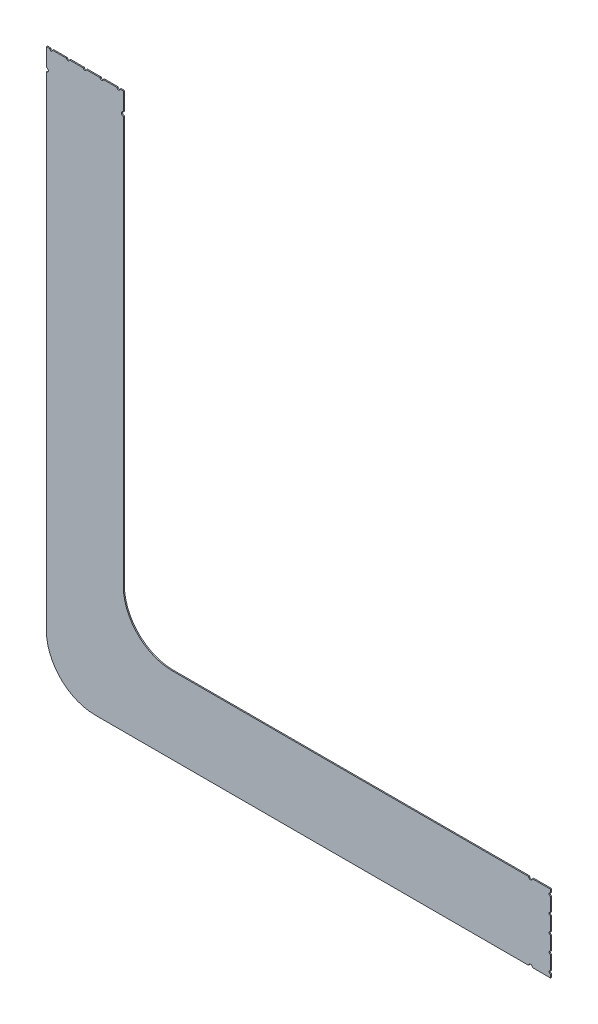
ISO-10303-21;
HEADER;
FILE_DESCRIPTION(('STEP AP214'),'2;1');
FILE_NAME('part.step','',(''),(''),'','','');
FILE_SCHEMA(('AUTOMOTIVE_DESIGN { 1 0 10303 214 1 1 1 1 }'));
ENDSEC;
DATA;
#1=APPLICATION_CONTEXT('core data for automotive mechanical design processes');
#2=APPLICATION_PROTOCOL_DEFINITION('international standard','automotive_design',2000,#1);
#3=PRODUCT_CONTEXT('',#1,'mechanical');
#4=PRODUCT('Part','Part','',(#3));
#5=PRODUCT_RELATED_PRODUCT_CATEGORY('part','',(#4));
#6=PRODUCT_DEFINITION_FORMATION('','',#4);
#7=PRODUCT_DEFINITION_CONTEXT('part definition',#1,'design');
#8=PRODUCT_DEFINITION('design','',#6,#7);
#9=PRODUCT_DEFINITION_SHAPE('','',#8);
#10=(LENGTH_UNIT() NAMED_UNIT(*) SI_UNIT(.MILLI.,.METRE.));
#11=(NAMED_UNIT(*) PLANE_ANGLE_UNIT() SI_UNIT($,.RADIAN.));
#12=(NAMED_UNIT(*) SI_UNIT($,.STERADIAN.) SOLID_ANGLE_UNIT());
#13=UNCERTAINTY_MEASURE_WITH_UNIT(LENGTH_MEASURE(1.E-05),#10,'distance_accuracy_value','');
#14=(GEOMETRIC_REPRESENTATION_CONTEXT(3) GLOBAL_UNCERTAINTY_ASSIGNED_CONTEXT((#13)) GLOBAL_UNIT_ASSIGNED_CONTEXT((#10,
#11,#12)) REPRESENTATION_CONTEXT('',''));
#15=CARTESIAN_POINT('',(0.,0.,0.));
#16=DIRECTION('',(0.,0.,1.));
#17=DIRECTION('',(1.,0.,0.));
#18=AXIS2_PLACEMENT_3D('',#15,#16,#17);
#19=CARTESIAN_POINT('',(65.5828,0.,0.14478));
#20=DIRECTION('',(0.,1.,0.));
#21=DIRECTION('',(0.,0.,1.));
#22=AXIS2_PLACEMENT_3D('',#19,#20,#21);
#23=PLANE('',#22);
#24=DIRECTION('',(0.,0.,-1.));
#25=VECTOR('',#24,1.);
#26=CARTESIAN_POINT('',(63.238329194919,0.,0.14478));
#27=LINE('',#26,#25);
#28=CARTESIAN_POINT('',(63.238329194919,0.,0.));
#29=VERTEX_POINT('',#28);
#30=CARTESIAN_POINT('',(63.238329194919,0.,0.14478));
#31=VERTEX_POINT('',#30);
#32=EDGE_CURVE('E513',#29,#31,#27,.F.);
#33=ORIENTED_EDGE('',*,*,#32,.F.);
#34=DIRECTION('',(1.,0.,0.));
#35=VECTOR('',#34,1.);
#36=CARTESIAN_POINT('',(65.5828,0.,0.));
#37=LINE('',#36,#35);
#38=CARTESIAN_POINT('',(65.5828,0.,0.));
#39=VERTEX_POINT('',#38);
#40=EDGE_CURVE('E371',#29,#39,#37,.T.);
#41=ORIENTED_EDGE('',*,*,#40,.T.);
#42=DIRECTION('',(0.,0.,-1.));
#43=VECTOR('',#42,1.);
#44=CARTESIAN_POINT('',(65.5828,0.,0.14478));
#45=LINE('',#44,#43);
#46=CARTESIAN_POINT('',(65.5828,0.,0.14478));
#47=VERTEX_POINT('',#46);
#48=EDGE_CURVE('E428',#47,#39,#45,.T.);
#49=ORIENTED_EDGE('',*,*,#48,.F.);
#50=DIRECTION('',(1.,0.,0.));
#51=VECTOR('',#50,1.);
#52=CARTESIAN_POINT('',(65.5828,0.,0.14478));
#53=LINE('',#52,#51);
#54=EDGE_CURVE('E542',#31,#47,#53,.T.);
#55=ORIENTED_EDGE('',*,*,#54,.F.);
#56=EDGE_LOOP('',(#33,#41,#49,#55));
#57=FACE_BOUND('',#56,.T.);
#58=ADVANCED_FACE('F15',(#57),#23,.F.);
#59=DIRECTION('',(0.,0.,-1.));
#60=VECTOR('',#59,1.);
#61=CARTESIAN_POINT('',(62.730430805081,0.,0.14478));
#62=LINE('',#61,#60);
#63=CARTESIAN_POINT('',(62.730430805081,0.,0.14478));
#64=VERTEX_POINT('',#63);
#65=CARTESIAN_POINT('',(62.730430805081,0.,0.));
#66=VERTEX_POINT('',#65);
#67=EDGE_CURVE('E30',#64,#66,#62,.T.);
#68=ORIENTED_EDGE('',*,*,#67,.F.);
#69=CARTESIAN_POINT('',(6.35,0.,0.14478));
#70=VERTEX_POINT('',#69);
#71=EDGE_CURVE('E335',#70,#64,#53,.T.);
#72=ORIENTED_EDGE('',*,*,#71,.F.);
#73=DIRECTION('',(0.,0.,-1.));
#74=VECTOR('',#73,1.);
#75=CARTESIAN_POINT('',(6.35,0.,0.14478));
#76=LINE('',#75,#74);
#77=CARTESIAN_POINT('',(6.35,0.,0.));
#78=VERTEX_POINT('',#77);
#79=EDGE_CURVE('E431',#70,#78,#76,.T.);
#80=ORIENTED_EDGE('',*,*,#79,.T.);
#81=EDGE_CURVE('E373',#78,#66,#37,.T.);
#82=ORIENTED_EDGE('',*,*,#81,.T.);
#83=EDGE_LOOP('',(#68,#72,#80,#82));
#84=FACE_BOUND('',#83,.T.);
#85=ADVANCED_FACE('F553',(#84),#23,.F.);
#86=CARTESIAN_POINT('',(65.5828,10.0076,0.14478));
#87=DIRECTION('',(-1.,0.,0.));
#88=DIRECTION('',(0.,0.,1.));
#89=AXIS2_PLACEMENT_3D('',#86,#87,#88);
#90=PLANE('',#89);
#91=DIRECTION('',(0.,0.,-1.));
#92=VECTOR('',#91,1.);
#93=CARTESIAN_POINT('',(65.5828,3.0099,0.14478));
#94=LINE('',#93,#92);
#95=CARTESIAN_POINT('',(65.5828,3.0099,0.));
#96=VERTEX_POINT('',#95);
#97=CARTESIAN_POINT('',(65.5828,3.0099,0.14478));
#98=VERTEX_POINT('',#97);
#99=EDGE_CURVE('E536',#96,#98,#94,.F.);
#100=ORIENTED_EDGE('',*,*,#99,.F.);
#101=DIRECTION('',(0.,1.,0.));
#102=VECTOR('',#101,1.);
#103=CARTESIAN_POINT('',(65.5828,10.0076,0.));
#104=LINE('',#103,#102);
#105=CARTESIAN_POINT('',(65.5828,4.81584,0.));
#106=VERTEX_POINT('',#105);
#107=EDGE_CURVE('E589',#96,#106,#104,.T.);
#108=ORIENTED_EDGE('',*,*,#107,.T.);
#109=DIRECTION('',(0.,0.,-1.));
#110=VECTOR('',#109,1.);
#111=CARTESIAN_POINT('',(65.5828,4.81584,0.14478));
#112=LINE('',#111,#110);
#113=CARTESIAN_POINT('',(65.5828,4.81584,0.14478));
#114=VERTEX_POINT('',#113);
#115=EDGE_CURVE('E525',#114,#106,#112,.T.);
#116=ORIENTED_EDGE('',*,*,#115,.F.);
#117=DIRECTION('',(0.,1.,0.));
#118=VECTOR('',#117,1.);
#119=CARTESIAN_POINT('',(65.5828,10.0076,0.14478));
#120=LINE('',#119,#118);
#121=EDGE_CURVE('E333',#98,#114,#120,.T.);
#122=ORIENTED_EDGE('',*,*,#121,.F.);
#123=EDGE_LOOP('',(#100,#108,#116,#122));
#124=FACE_BOUND('',#123,.T.);
#125=ADVANCED_FACE('F586',(#124),#90,.F.);
#126=DIRECTION('',(0.,0.,-1.));
#127=VECTOR('',#126,1.);
#128=CARTESIAN_POINT('',(65.5828,2.6289,0.14478));
#129=LINE('',#128,#127);
#130=CARTESIAN_POINT('',(65.5828,2.6289,0.14478));
#131=VERTEX_POINT('',#130);
#132=CARTESIAN_POINT('',(65.5828,2.6289,0.));
#133=VERTEX_POINT('',#132);
#134=EDGE_CURVE('E534',#131,#133,#129,.T.);
#135=ORIENTED_EDGE('',*,*,#134,.F.);
#136=CARTESIAN_POINT('',(65.5828,0.822959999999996,0.14478));
#137=VERTEX_POINT('',#136);
#138=EDGE_CURVE('E341',#137,#131,#120,.T.);
#139=ORIENTED_EDGE('',*,*,#138,.F.);
#140=DIRECTION('',(0.,0.,-1.));
#141=VECTOR('',#140,1.);
#142=CARTESIAN_POINT('',(65.5828,0.822959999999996,0.14478));
#143=LINE('',#142,#141);
#144=CARTESIAN_POINT('',(65.5828,0.822959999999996,0.));
#145=VERTEX_POINT('',#144);
#146=EDGE_CURVE('E523',#145,#137,#143,.F.);
#147=ORIENTED_EDGE('',*,*,#146,.F.);
#148=EDGE_CURVE('E382',#145,#133,#104,.T.);
#149=ORIENTED_EDGE('',*,*,#148,.T.);
#150=EDGE_LOOP('',(#135,#139,#147,#149));
#151=FACE_BOUND('',#150,.T.);
#152=ADVANCED_FACE('F574',(#151),#90,.F.);
#153=DIRECTION('',(0.,0.,-1.));
#154=VECTOR('',#153,1.);
#155=CARTESIAN_POINT('',(65.5828,5.19684,0.14478));
#156=LINE('',#155,#154);
#157=CARTESIAN_POINT('',(65.5828,5.19684,0.));
#158=VERTEX_POINT('',#157);
#159=CARTESIAN_POINT('',(65.5828,5.19684,0.14478));
#160=VERTEX_POINT('',#159);
#161=EDGE_CURVE('E528',#158,#160,#156,.F.);
#162=ORIENTED_EDGE('',*,*,#161,.F.);
#163=CARTESIAN_POINT('',(65.5828,7.00278,0.));
#164=VERTEX_POINT('',#163);
#165=EDGE_CURVE('E598',#158,#164,#104,.T.);
#166=ORIENTED_EDGE('',*,*,#165,.T.);
#167=DIRECTION('',(0.,0.,-1.));
#168=VECTOR('',#167,1.);
#169=CARTESIAN_POINT('',(65.5828,7.00278,0.14478));
#170=LINE('',#169,#168);
#171=CARTESIAN_POINT('',(65.5828,7.00278,0.14478));
#172=VERTEX_POINT('',#171);
#173=EDGE_CURVE('E311',#172,#164,#170,.T.);
#174=ORIENTED_EDGE('',*,*,#173,.F.);
#175=EDGE_CURVE('E322',#160,#172,#120,.T.);
#176=ORIENTED_EDGE('',*,*,#175,.F.);
#177=EDGE_LOOP('',(#162,#166,#174,#176));
#178=FACE_BOUND('',#177,.T.);
#179=ADVANCED_FACE('F998',(#178),#90,.F.);
#180=DIRECTION('',(0.,0.,-1.));
#181=VECTOR('',#180,1.);
#182=CARTESIAN_POINT('',(65.5828,0.441960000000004,0.14478));
#183=LINE('',#182,#181);
#184=CARTESIAN_POINT('',(65.5828,0.441960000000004,0.14478));
#185=VERTEX_POINT('',#184);
#186=CARTESIAN_POINT('',(65.5828,0.441960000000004,0.));
#187=VERTEX_POINT('',#186);
#188=EDGE_CURVE('E521',#185,#187,#183,.T.);
#189=ORIENTED_EDGE('',*,*,#188,.F.);
#190=EDGE_CURVE('E336',#47,#185,#120,.T.);
#191=ORIENTED_EDGE('',*,*,#190,.F.);
#192=ORIENTED_EDGE('',*,*,#48,.T.);
#193=EDGE_CURVE('E378',#39,#187,#104,.T.);
#194=ORIENTED_EDGE('',*,*,#193,.T.);
#195=EDGE_LOOP('',(#189,#191,#192,#194));
#196=FACE_BOUND('',#195,.T.);
#197=ADVANCED_FACE('F562',(#196),#90,.F.);
#198=DIRECTION('',(0.,0.,-1.));
#199=VECTOR('',#198,1.);
#200=CARTESIAN_POINT('',(65.5828,9.57072,0.14478));
#201=LINE('',#200,#199);
#202=CARTESIAN_POINT('',(65.5828,9.57072,0.));
#203=VERTEX_POINT('',#202);
#204=CARTESIAN_POINT('',(65.5828,9.57072,0.14478));
#205=VERTEX_POINT('',#204);
#206=EDGE_CURVE('E645',#203,#205,#201,.F.);
#207=ORIENTED_EDGE('',*,*,#206,.F.);
#208=CARTESIAN_POINT('',(65.5828,10.0076,0.));
#209=VERTEX_POINT('',#208);
#210=EDGE_CURVE('E377',#203,#209,#104,.T.);
#211=ORIENTED_EDGE('',*,*,#210,.T.);
#212=DIRECTION('',(0.,0.,-1.));
#213=VECTOR('',#212,1.);
#214=CARTESIAN_POINT('',(65.5828,10.0076,0.14478));
#215=LINE('',#214,#213);
#216=CARTESIAN_POINT('',(65.5828,10.0076,0.14478));
#217=VERTEX_POINT('',#216);
#218=EDGE_CURVE('E424',#217,#209,#215,.T.);
#219=ORIENTED_EDGE('',*,*,#218,.F.);
#220=EDGE_CURVE('E327',#205,#217,#120,.T.);
#221=ORIENTED_EDGE('',*,*,#220,.F.);
#222=EDGE_LOOP('',(#207,#211,#219,#221));
#223=FACE_BOUND('',#222,.T.);
#224=ADVANCED_FACE('F809',(#223),#90,.F.);
#225=DIRECTION('',(0.,0.,-1.));
#226=VECTOR('',#225,1.);
#227=CARTESIAN_POINT('',(65.5828,9.18972,0.14478));
#228=LINE('',#227,#226);
#229=CARTESIAN_POINT('',(65.5828,9.18972,0.14478));
#230=VERTEX_POINT('',#229);
#231=CARTESIAN_POINT('',(65.5828,9.18972,0.));
#232=VERTEX_POINT('',#231);
#233=EDGE_CURVE('E42',#230,#232,#228,.T.);
#234=ORIENTED_EDGE('',*,*,#233,.F.);
#235=CARTESIAN_POINT('',(65.5828,7.38378,0.14478));
#236=VERTEX_POINT('',#235);
#237=EDGE_CURVE('E319',#236,#230,#120,.T.);
#238=ORIENTED_EDGE('',*,*,#237,.F.);
#239=DIRECTION('',(0.,0.,-1.));
#240=VECTOR('',#239,1.);
#241=CARTESIAN_POINT('',(65.5828,7.38378,0.14478));
#242=LINE('',#241,#240);
#243=CARTESIAN_POINT('',(65.5828,7.38378,0.));
#244=VERTEX_POINT('',#243);
#245=EDGE_CURVE('E298',#244,#236,#242,.F.);
#246=ORIENTED_EDGE('',*,*,#245,.F.);
#247=EDGE_CURVE('E802',#244,#232,#104,.T.);
#248=ORIENTED_EDGE('',*,*,#247,.T.);
#249=EDGE_LOOP('',(#234,#238,#246,#248));
#250=FACE_BOUND('',#249,.T.);
#251=ADVANCED_FACE('F325',(#250),#90,.F.);
#252=CARTESIAN_POINT('',(16.3576,10.0076,0.14478));
#253=DIRECTION('',(0.,-1.,0.));
#254=DIRECTION('',(0.,0.,-1.));
#255=AXIS2_PLACEMENT_3D('',#252,#253,#254);
#256=PLANE('',#255);
#257=DIRECTION('',(0.,0.,-1.));
#258=VECTOR('',#257,1.);
#259=CARTESIAN_POINT('',(62.73038,10.0076,0.14478));
#260=LINE('',#259,#258);
#261=CARTESIAN_POINT('',(62.73038,10.0076,0.));
#262=VERTEX_POINT('',#261);
#263=CARTESIAN_POINT('',(62.73038,10.0076,0.14478));
#264=VERTEX_POINT('',#263);
#265=EDGE_CURVE('E640',#262,#264,#260,.F.);
#266=ORIENTED_EDGE('',*,*,#265,.F.);
#267=DIRECTION('',(-1.,0.,0.));
#268=VECTOR('',#267,1.);
#269=CARTESIAN_POINT('',(16.3576,10.0076,0.));
#270=LINE('',#269,#268);
#271=CARTESIAN_POINT('',(16.3576,10.0076,0.));
#272=VERTEX_POINT('',#271);
#273=EDGE_CURVE('E381',#262,#272,#270,.T.);
#274=ORIENTED_EDGE('',*,*,#273,.T.);
#275=DIRECTION('',(0.,0.,-1.));
#276=VECTOR('',#275,1.);
#277=CARTESIAN_POINT('',(16.3576,10.0076,0.14478));
#278=LINE('',#277,#276);
#279=CARTESIAN_POINT('',(16.3576,10.0076,0.14478));
#280=VERTEX_POINT('',#279);
#281=EDGE_CURVE('E420',#280,#272,#278,.T.);
#282=ORIENTED_EDGE('',*,*,#281,.F.);
#283=DIRECTION('',(-1.,0.,0.));
#284=VECTOR('',#283,1.);
#285=CARTESIAN_POINT('',(16.3576,10.0076,0.14478));
#286=LINE('',#285,#284);
#287=EDGE_CURVE('E340',#264,#280,#286,.T.);
#288=ORIENTED_EDGE('',*,*,#287,.F.);
#289=EDGE_LOOP('',(#266,#274,#282,#288));
#290=FACE_BOUND('',#289,.T.);
#291=ADVANCED_FACE('F744',(#290),#256,.F.);
#292=DIRECTION('',(0.,0.,-1.));
#293=VECTOR('',#292,1.);
#294=CARTESIAN_POINT('',(63.23838,10.0076,0.14478));
#295=LINE('',#294,#293);
#296=CARTESIAN_POINT('',(63.23838,10.0076,0.14478));
#297=VERTEX_POINT('',#296);
#298=CARTESIAN_POINT('',(63.23838,10.0076,0.));
#299=VERTEX_POINT('',#298);
#300=EDGE_CURVE('E637',#297,#299,#295,.T.);
#301=ORIENTED_EDGE('',*,*,#300,.F.);
#302=EDGE_CURVE('E343',#217,#297,#286,.T.);
#303=ORIENTED_EDGE('',*,*,#302,.F.);
#304=ORIENTED_EDGE('',*,*,#218,.T.);
#305=EDGE_CURVE('E383',#209,#299,#270,.T.);
#306=ORIENTED_EDGE('',*,*,#305,.T.);
#307=EDGE_LOOP('',(#301,#303,#304,#306));
#308=FACE_BOUND('',#307,.T.);
#309=ADVANCED_FACE('F747',(#308),#256,.F.);
#310=CARTESIAN_POINT('',(10.0076,72.13854,0.14478));
#311=DIRECTION('',(-1.,0.,0.));
#312=DIRECTION('',(0.,0.,1.));
#313=AXIS2_PLACEMENT_3D('',#310,#311,#312);
#314=PLANE('',#313);
#315=DIRECTION('',(0.,0.,-1.));
#316=VECTOR('',#315,1.);
#317=CARTESIAN_POINT('',(10.0076,69.794069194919,0.14478));
#318=LINE('',#317,#316);
#319=CARTESIAN_POINT('',(10.0076,69.794069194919,0.));
#320=VERTEX_POINT('',#319);
#321=CARTESIAN_POINT('',(10.0076,69.794069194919,0.14478));
#322=VERTEX_POINT('',#321);
#323=EDGE_CURVE('E634',#320,#322,#318,.F.);
#324=ORIENTED_EDGE('',*,*,#323,.F.);
#325=DIRECTION('',(0.,1.,0.));
#326=VECTOR('',#325,1.);
#327=CARTESIAN_POINT('',(10.0076,72.13854,0.));
#328=LINE('',#327,#326);
#329=CARTESIAN_POINT('',(10.0076,72.13854,0.));
#330=VERTEX_POINT('',#329);
#331=EDGE_CURVE('E390',#320,#330,#328,.T.);
#332=ORIENTED_EDGE('',*,*,#331,.T.);
#333=DIRECTION('',(0.,0.,-1.));
#334=VECTOR('',#333,1.);
#335=CARTESIAN_POINT('',(10.0076,72.13854,0.14478));
#336=LINE('',#335,#334);
#337=CARTESIAN_POINT('',(10.0076,72.13854,0.14478));
#338=VERTEX_POINT('',#337);
#339=EDGE_CURVE('E412',#338,#330,#336,.T.);
#340=ORIENTED_EDGE('',*,*,#339,.F.);
#341=DIRECTION('',(0.,1.,0.));
#342=VECTOR('',#341,1.);
#343=CARTESIAN_POINT('',(10.0076,72.13854,0.14478));
#344=LINE('',#343,#342);
#345=EDGE_CURVE('E350',#322,#338,#344,.T.);
#346=ORIENTED_EDGE('',*,*,#345,.F.);
#347=EDGE_LOOP('',(#324,#332,#340,#346));
#348=FACE_BOUND('',#347,.T.);
#349=ADVANCED_FACE('F716',(#348),#314,.F.);
#350=DIRECTION('',(0.,0.,-1.));
#351=VECTOR('',#350,1.);
#352=CARTESIAN_POINT('',(10.0076,69.286170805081,0.14478));
#353=LINE('',#352,#351);
#354=CARTESIAN_POINT('',(10.0076,69.286170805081,0.14478));
#355=VERTEX_POINT('',#354);
#356=CARTESIAN_POINT('',(10.0076,69.286170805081,0.));
#357=VERTEX_POINT('',#356);
#358=EDGE_CURVE('E631',#355,#357,#353,.T.);
#359=ORIENTED_EDGE('',*,*,#358,.F.);
#360=CARTESIAN_POINT('',(10.0076,16.3576,0.14478));
#361=VERTEX_POINT('',#360);
#362=EDGE_CURVE('E351',#361,#355,#344,.T.);
#363=ORIENTED_EDGE('',*,*,#362,.F.);
#364=DIRECTION('',(0.,0.,-1.));
#365=VECTOR('',#364,1.);
#366=CARTESIAN_POINT('',(10.0076,16.3576,0.14478));
#367=LINE('',#366,#365);
#368=CARTESIAN_POINT('',(10.0076,16.3576,0.));
#369=VERTEX_POINT('',#368);
#370=EDGE_CURVE('E416',#361,#369,#367,.T.);
#371=ORIENTED_EDGE('',*,*,#370,.T.);
#372=EDGE_CURVE('E391',#369,#357,#328,.T.);
#373=ORIENTED_EDGE('',*,*,#372,.T.);
#374=EDGE_LOOP('',(#359,#363,#371,#373));
#375=FACE_BOUND('',#374,.T.);
#376=ADVANCED_FACE('F755',(#375),#314,.F.);
#377=CARTESIAN_POINT('',(0.,72.13854,0.14478));
#378=DIRECTION('',(0.,-1.,0.));
#379=DIRECTION('',(0.,0.,-1.));
#380=AXIS2_PLACEMENT_3D('',#377,#378,#379);
#381=PLANE('',#380);
#382=DIRECTION('',(0.,0.,-1.));
#383=VECTOR('',#382,1.);
#384=CARTESIAN_POINT('',(0.43688,72.13854,0.14478));
#385=LINE('',#384,#383);
#386=CARTESIAN_POINT('',(0.43688,72.13854,0.));
#387=VERTEX_POINT('',#386);
#388=CARTESIAN_POINT('',(0.43688,72.13854,0.14478));
#389=VERTEX_POINT('',#388);
#390=EDGE_CURVE('E372',#387,#389,#385,.F.);
#391=ORIENTED_EDGE('',*,*,#390,.F.);
#392=DIRECTION('',(-1.,0.,0.));
#393=VECTOR('',#392,1.);
#394=CARTESIAN_POINT('',(0.,72.13854,0.));
#395=LINE('',#394,#393);
#396=CARTESIAN_POINT('',(0.,72.13854,0.));
#397=VERTEX_POINT('',#396);
#398=EDGE_CURVE('E395',#387,#397,#395,.T.);
#399=ORIENTED_EDGE('',*,*,#398,.T.);
#400=DIRECTION('',(0.,0.,-1.));
#401=VECTOR('',#400,1.);
#402=CARTESIAN_POINT('',(0.,72.13854,0.14478));
#403=LINE('',#402,#401);
#404=CARTESIAN_POINT('',(0.,72.13854,0.14478));
#405=VERTEX_POINT('',#404);
#406=EDGE_CURVE('E409',#405,#397,#403,.T.);
#407=ORIENTED_EDGE('',*,*,#406,.F.);
#408=DIRECTION('',(-1.,0.,0.));
#409=VECTOR('',#408,1.);
#410=CARTESIAN_POINT('',(0.,72.13854,0.14478));
#411=LINE('',#410,#409);
#412=EDGE_CURVE('E355',#389,#405,#411,.T.);
#413=ORIENTED_EDGE('',*,*,#412,.F.);
#414=EDGE_LOOP('',(#391,#399,#407,#413));
#415=FACE_BOUND('',#414,.T.);
#416=ADVANCED_FACE('F492',(#415),#381,.F.);
#417=DIRECTION('',(0.,0.,-1.));
#418=VECTOR('',#417,1.);
#419=CARTESIAN_POINT('',(0.81788,72.13854,0.14478));
#420=LINE('',#419,#418);
#421=CARTESIAN_POINT('',(0.81788,72.13854,0.14478));
#422=VERTEX_POINT('',#421);
#423=CARTESIAN_POINT('',(0.81788,72.13854,0.));
#424=VERTEX_POINT('',#423);
#425=EDGE_CURVE('E538',#422,#424,#420,.T.);
#426=ORIENTED_EDGE('',*,*,#425,.F.);
#427=CARTESIAN_POINT('',(2.62382,72.13854,0.14478));
#428=VERTEX_POINT('',#427);
#429=EDGE_CURVE('E675',#428,#422,#411,.T.);
#430=ORIENTED_EDGE('',*,*,#429,.F.);
#431=DIRECTION('',(0.,0.,-1.));
#432=VECTOR('',#431,1.);
#433=CARTESIAN_POINT('',(2.62382,72.13854,0.14478));
#434=LINE('',#433,#432);
#435=CARTESIAN_POINT('',(2.62382,72.13854,0.));
#436=VERTEX_POINT('',#435);
#437=EDGE_CURVE('E532',#436,#428,#434,.F.);
#438=ORIENTED_EDGE('',*,*,#437,.F.);
#439=EDGE_CURVE('E468',#436,#424,#395,.T.);
#440=ORIENTED_EDGE('',*,*,#439,.T.);
#441=EDGE_LOOP('',(#426,#430,#438,#440));
#442=FACE_BOUND('',#441,.T.);
#443=ADVANCED_FACE('F681',(#442),#381,.F.);
#444=DIRECTION('',(0.,0.,-1.));
#445=VECTOR('',#444,1.);
#446=CARTESIAN_POINT('',(3.00482,72.13854,0.14478));
#447=LINE('',#446,#445);
#448=CARTESIAN_POINT('',(3.00482,72.13854,0.14478));
#449=VERTEX_POINT('',#448);
#450=CARTESIAN_POINT('',(3.00482,72.13854,0.));
#451=VERTEX_POINT('',#450);
#452=EDGE_CURVE('E476',#449,#451,#447,.T.);
#453=ORIENTED_EDGE('',*,*,#452,.F.);
#454=CARTESIAN_POINT('',(4.81076,72.13854,0.14478));
#455=VERTEX_POINT('',#454);
#456=EDGE_CURVE('E672',#455,#449,#411,.T.);
#457=ORIENTED_EDGE('',*,*,#456,.F.);
#458=DIRECTION('',(0.,0.,-1.));
#459=VECTOR('',#458,1.);
#460=CARTESIAN_POINT('',(4.81076,72.13854,0.14478));
#461=LINE('',#460,#459);
#462=CARTESIAN_POINT('',(4.81076,72.13854,0.));
#463=VERTEX_POINT('',#462);
#464=EDGE_CURVE('E478',#463,#455,#461,.F.);
#465=ORIENTED_EDGE('',*,*,#464,.F.);
#466=EDGE_CURVE('E466',#463,#451,#395,.T.);
#467=ORIENTED_EDGE('',*,*,#466,.T.);
#468=EDGE_LOOP('',(#453,#457,#465,#467));
#469=FACE_BOUND('',#468,.T.);
#470=ADVANCED_FACE('F474',(#469),#381,.F.);
#471=DIRECTION('',(0.,0.,-1.));
#472=VECTOR('',#471,1.);
#473=CARTESIAN_POINT('',(6.9977,72.13854,0.14478));
#474=LINE('',#473,#472);
#475=CARTESIAN_POINT('',(6.9977,72.13854,0.));
#476=VERTEX_POINT('',#475);
#477=CARTESIAN_POINT('',(6.9977,72.13854,0.14478));
#478=VERTEX_POINT('',#477);
#479=EDGE_CURVE('E516',#476,#478,#474,.F.);
#480=ORIENTED_EDGE('',*,*,#479,.F.);
#481=CARTESIAN_POINT('',(5.19176,72.13854,0.));
#482=VERTEX_POINT('',#481);
#483=EDGE_CURVE('E480',#476,#482,#395,.T.);
#484=ORIENTED_EDGE('',*,*,#483,.T.);
#485=DIRECTION('',(0.,0.,-1.));
#486=VECTOR('',#485,1.);
#487=CARTESIAN_POINT('',(5.19176,72.13854,0.14478));
#488=LINE('',#487,#486);
#489=CARTESIAN_POINT('',(5.19176,72.13854,0.14478));
#490=VERTEX_POINT('',#489);
#491=EDGE_CURVE('E310',#490,#482,#488,.T.);
#492=ORIENTED_EDGE('',*,*,#491,.F.);
#493=EDGE_CURVE('E666',#478,#490,#411,.T.);
#494=ORIENTED_EDGE('',*,*,#493,.F.);
#495=EDGE_LOOP('',(#480,#484,#492,#494));
#496=FACE_BOUND('',#495,.T.);
#497=ADVANCED_FACE('F670',(#496),#381,.F.);
#498=DIRECTION('',(0.,0.,-1.));
#499=VECTOR('',#498,1.);
#500=CARTESIAN_POINT('',(7.3787,72.13854,0.14478));
#501=LINE('',#500,#499);
#502=CARTESIAN_POINT('',(7.3787,72.13854,0.14478));
#503=VERTEX_POINT('',#502);
#504=CARTESIAN_POINT('',(7.3787,72.13854,0.));
#505=VERTEX_POINT('',#504);
#506=EDGE_CURVE('E652',#503,#505,#501,.T.);
#507=ORIENTED_EDGE('',*,*,#506,.F.);
#508=CARTESIAN_POINT('',(9.18464,72.13854,0.14478));
#509=VERTEX_POINT('',#508);
#510=EDGE_CURVE('E361',#509,#503,#411,.T.);
#511=ORIENTED_EDGE('',*,*,#510,.F.);
#512=DIRECTION('',(0.,0.,-1.));
#513=VECTOR('',#512,1.);
#514=CARTESIAN_POINT('',(9.18464,72.13854,0.14478));
#515=LINE('',#514,#513);
#516=CARTESIAN_POINT('',(9.18464,72.13854,0.));
#517=VERTEX_POINT('',#516);
#518=EDGE_CURVE('E649',#517,#509,#515,.F.);
#519=ORIENTED_EDGE('',*,*,#518,.F.);
#520=EDGE_CURVE('E401',#517,#505,#395,.T.);
#521=ORIENTED_EDGE('',*,*,#520,.T.);
#522=EDGE_LOOP('',(#507,#511,#519,#521));
#523=FACE_BOUND('',#522,.T.);
#524=ADVANCED_FACE('F721',(#523),#381,.F.);
#525=DIRECTION('',(0.,0.,-1.));
#526=VECTOR('',#525,1.);
#527=CARTESIAN_POINT('',(9.56564,72.13854,0.14478));
#528=LINE('',#527,#526);
#529=CARTESIAN_POINT('',(9.56564,72.13854,0.14478));
#530=VERTEX_POINT('',#529);
#531=CARTESIAN_POINT('',(9.56564,72.13854,0.));
#532=VERTEX_POINT('',#531);
#533=EDGE_CURVE('E647',#530,#532,#528,.T.);
#534=ORIENTED_EDGE('',*,*,#533,.F.);
#535=EDGE_CURVE('E356',#338,#530,#411,.T.);
#536=ORIENTED_EDGE('',*,*,#535,.F.);
#537=ORIENTED_EDGE('',*,*,#339,.T.);
#538=EDGE_CURVE('E396',#330,#532,#395,.T.);
#539=ORIENTED_EDGE('',*,*,#538,.T.);
#540=EDGE_LOOP('',(#534,#536,#537,#539));
#541=FACE_BOUND('',#540,.T.);
#542=ADVANCED_FACE('F708',(#541),#381,.F.);
#543=CARTESIAN_POINT('',(0.,6.35,0.14478));
#544=DIRECTION('',(1.,0.,0.));
#545=DIRECTION('',(0.,0.,-1.));
#546=AXIS2_PLACEMENT_3D('',#543,#544,#545);
#547=PLANE('',#546);
#548=DIRECTION('',(0.,0.,-1.));
#549=VECTOR('',#548,1.);
#550=CARTESIAN_POINT('',(0.,69.28612,0.14478));
#551=LINE('',#550,#549);
#552=CARTESIAN_POINT('',(0.,69.28612,0.));
#553=VERTEX_POINT('',#552);
#554=CARTESIAN_POINT('',(0.,69.28612,0.14478));
#555=VERTEX_POINT('',#554);
#556=EDGE_CURVE('E504',#553,#555,#551,.F.);
#557=ORIENTED_EDGE('',*,*,#556,.F.);
#558=DIRECTION('',(0.,-1.,0.));
#559=VECTOR('',#558,1.);
#560=CARTESIAN_POINT('',(0.,6.35,0.));
#561=LINE('',#560,#559);
#562=CARTESIAN_POINT('',(0.,6.35,0.));
#563=VERTEX_POINT('',#562);
#564=EDGE_CURVE('E400',#553,#563,#561,.T.);
#565=ORIENTED_EDGE('',*,*,#564,.T.);
#566=DIRECTION('',(0.,0.,-1.));
#567=VECTOR('',#566,1.);
#568=CARTESIAN_POINT('',(0.,6.35,0.14478));
#569=LINE('',#568,#567);
#570=CARTESIAN_POINT('',(0.,6.35,0.14478));
#571=VERTEX_POINT('',#570);
#572=EDGE_CURVE('E366',#571,#563,#569,.T.);
#573=ORIENTED_EDGE('',*,*,#572,.F.);
#574=DIRECTION('',(0.,-1.,0.));
#575=VECTOR('',#574,1.);
#576=CARTESIAN_POINT('',(0.,6.35,0.14478));
#577=LINE('',#576,#575);
#578=EDGE_CURVE('E360',#555,#571,#577,.T.);
#579=ORIENTED_EDGE('',*,*,#578,.F.);
#580=EDGE_LOOP('',(#557,#565,#573,#579));
#581=FACE_BOUND('',#580,.T.);
#582=ADVANCED_FACE('F509',(#581),#547,.F.);
#583=DIRECTION('',(0.,0.,-1.));
#584=VECTOR('',#583,1.);
#585=CARTESIAN_POINT('',(0.,69.79412,0.14478));
#586=LINE('',#585,#584);
#587=CARTESIAN_POINT('',(0.,69.79412,0.14478));
#588=VERTEX_POINT('',#587);
#589=CARTESIAN_POINT('',(0.,69.79412,0.));
#590=VERTEX_POINT('',#589);
#591=EDGE_CURVE('E506',#588,#590,#586,.T.);
#592=ORIENTED_EDGE('',*,*,#591,.F.);
#593=EDGE_CURVE('E362',#405,#588,#577,.T.);
#594=ORIENTED_EDGE('',*,*,#593,.F.);
#595=ORIENTED_EDGE('',*,*,#406,.T.);
#596=EDGE_CURVE('E402',#397,#590,#561,.T.);
#597=ORIENTED_EDGE('',*,*,#596,.T.);
#598=EDGE_LOOP('',(#592,#594,#595,#597));
#599=FACE_BOUND('',#598,.T.);
#600=ADVANCED_FACE('F498',(#599),#547,.F.);
#601=CARTESIAN_POINT('',(6.35,6.35,0.14478));
#602=DIRECTION('',(0.,0.,-1.));
#603=DIRECTION('',(-1.,0.,0.));
#604=AXIS2_PLACEMENT_3D('',#601,#602,#603);
#605=CYLINDRICAL_SURFACE('',#604,6.35);
#606=CARTESIAN_POINT('',(6.35,6.35,0.));
#607=DIRECTION('',(0.,0.,1.));
#608=DIRECTION('',(-1.,0.,0.));
#609=AXIS2_PLACEMENT_3D('',#606,#607,#608);
#610=CIRCLE('',#609,6.35);
#611=EDGE_CURVE('E367',#563,#78,#610,.T.);
#612=ORIENTED_EDGE('',*,*,#611,.T.);
#613=ORIENTED_EDGE('',*,*,#79,.F.);
#614=CARTESIAN_POINT('',(6.35,6.35,0.14478));
#615=DIRECTION('',(0.,0.,1.));
#616=DIRECTION('',(-1.,0.,0.));
#617=AXIS2_PLACEMENT_3D('',#614,#615,#616);
#618=CIRCLE('',#617,6.35);
#619=EDGE_CURVE('E406',#571,#70,#618,.T.);
#620=ORIENTED_EDGE('',*,*,#619,.F.);
#621=ORIENTED_EDGE('',*,*,#572,.T.);
#622=EDGE_LOOP('',(#612,#613,#620,#621));
#623=FACE_BOUND('',#622,.T.);
#624=ADVANCED_FACE('F17',(#623),#605,.T.);
#625=CARTESIAN_POINT('',(16.3576,16.3576,0.14478));
#626=DIRECTION('',(0.,0.,-1.));
#627=DIRECTION('',(-1.,0.,0.));
#628=AXIS2_PLACEMENT_3D('',#625,#626,#627);
#629=CYLINDRICAL_SURFACE('',#628,6.35);
#630=CARTESIAN_POINT('',(16.3576,16.3576,0.));
#631=DIRECTION('',(0.,0.,-1.));
#632=DIRECTION('',(1.,0.,0.));
#633=AXIS2_PLACEMENT_3D('',#630,#631,#632);
#634=CIRCLE('',#633,6.35);
#635=EDGE_CURVE('E387',#272,#369,#634,.T.);
#636=ORIENTED_EDGE('',*,*,#635,.T.);
#637=ORIENTED_EDGE('',*,*,#370,.F.);
#638=CARTESIAN_POINT('',(16.3576,16.3576,0.14478));
#639=DIRECTION('',(0.,0.,-1.));
#640=DIRECTION('',(1.,0.,0.));
#641=AXIS2_PLACEMENT_3D('',#638,#639,#640);
#642=CIRCLE('',#641,6.35);
#643=EDGE_CURVE('E347',#280,#361,#642,.T.);
#644=ORIENTED_EDGE('',*,*,#643,.F.);
#645=ORIENTED_EDGE('',*,*,#281,.T.);
#646=EDGE_LOOP('',(#636,#637,#644,#645));
#647=FACE_BOUND('',#646,.T.);
#648=ADVANCED_FACE('F749',(#647),#629,.F.);
#649=CARTESIAN_POINT('',(6.35,6.35,0.14478));
#650=DIRECTION('',(0.,0.,-1.));
#651=DIRECTION('',(-1.,0.,0.));
#652=AXIS2_PLACEMENT_3D('',#649,#650,#651);
#653=PLANE('',#652);
#654=CARTESIAN_POINT('',(0.62738,72.13854,0.14478));
#655=DIRECTION('',(0.,0.,1.));
#656=DIRECTION('',(1.,0.,0.));
#657=AXIS2_PLACEMENT_3D('',#654,#655,#656);
#658=CIRCLE('',#657,0.1905);
#659=EDGE_CURVE('E610',#389,#422,#658,.T.);
#660=ORIENTED_EDGE('',*,*,#659,.F.);
#661=ORIENTED_EDGE('',*,*,#412,.T.);
#662=ORIENTED_EDGE('',*,*,#593,.T.);
#663=CARTESIAN_POINT('',(0.,69.54012,0.14478));
#664=DIRECTION('',(0.,0.,1.));
#665=DIRECTION('',(1.,0.,0.));
#666=AXIS2_PLACEMENT_3D('',#663,#664,#665);
#667=CIRCLE('',#666,0.254);
#668=EDGE_CURVE('E618',#555,#588,#667,.T.);
#669=ORIENTED_EDGE('',*,*,#668,.F.);
#670=ORIENTED_EDGE('',*,*,#578,.T.);
#671=ORIENTED_EDGE('',*,*,#619,.T.);
#672=ORIENTED_EDGE('',*,*,#71,.T.);
#673=CARTESIAN_POINT('',(62.98438,0.00508,0.14478));
#674=DIRECTION('',(0.,0.,1.));
#675=DIRECTION('',(1.,0.,0.));
#676=AXIS2_PLACEMENT_3D('',#673,#674,#675);
#677=CIRCLE('',#676,0.254000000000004);
#678=EDGE_CURVE('E551',#31,#64,#677,.T.);
#679=ORIENTED_EDGE('',*,*,#678,.F.);
#680=ORIENTED_EDGE('',*,*,#54,.T.);
#681=ORIENTED_EDGE('',*,*,#190,.T.);
#682=CARTESIAN_POINT('',(65.5828,0.63246,0.14478));
#683=DIRECTION('',(0.,0.,1.));
#684=DIRECTION('',(1.,0.,0.));
#685=AXIS2_PLACEMENT_3D('',#682,#683,#684);
#686=CIRCLE('',#685,0.190499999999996);
#687=EDGE_CURVE('E565',#137,#185,#686,.T.);
#688=ORIENTED_EDGE('',*,*,#687,.F.);
#689=ORIENTED_EDGE('',*,*,#138,.T.);
#690=CARTESIAN_POINT('',(65.5828,2.8194,0.14478));
#691=DIRECTION('',(0.,0.,1.));
#692=DIRECTION('',(1.,0.,0.));
#693=AXIS2_PLACEMENT_3D('',#690,#691,#692);
#694=CIRCLE('',#693,0.190499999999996);
#695=EDGE_CURVE('E582',#98,#131,#694,.T.);
#696=ORIENTED_EDGE('',*,*,#695,.F.);
#697=ORIENTED_EDGE('',*,*,#121,.T.);
#698=CARTESIAN_POINT('',(65.5828,5.00634,0.14478));
#699=DIRECTION('',(0.,0.,1.));
#700=DIRECTION('',(1.,0.,0.));
#701=AXIS2_PLACEMENT_3D('',#698,#699,#700);
#702=CIRCLE('',#701,0.190499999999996);
#703=EDGE_CURVE('E581',#160,#114,#702,.T.);
#704=ORIENTED_EDGE('',*,*,#703,.F.);
#705=ORIENTED_EDGE('',*,*,#175,.T.);
#706=CARTESIAN_POINT('',(65.5828,7.19328,0.14478));
#707=DIRECTION('',(0.,0.,1.));
#708=DIRECTION('',(1.,0.,0.));
#709=AXIS2_PLACEMENT_3D('',#706,#707,#708);
#710=CIRCLE('',#709,0.190499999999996);
#711=EDGE_CURVE('E301',#236,#172,#710,.T.);
#712=ORIENTED_EDGE('',*,*,#711,.F.);
#713=ORIENTED_EDGE('',*,*,#237,.T.);
#714=CARTESIAN_POINT('',(65.5828,9.38022,0.14478));
#715=DIRECTION('',(0.,0.,1.));
#716=DIRECTION('',(1.,0.,0.));
#717=AXIS2_PLACEMENT_3D('',#714,#715,#716);
#718=CIRCLE('',#717,0.190499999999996);
#719=EDGE_CURVE('E687',#205,#230,#718,.T.);
#720=ORIENTED_EDGE('',*,*,#719,.F.);
#721=ORIENTED_EDGE('',*,*,#220,.T.);
#722=ORIENTED_EDGE('',*,*,#302,.T.);
#723=CARTESIAN_POINT('',(62.98438,10.0076,0.14478));
#724=DIRECTION('',(0.,0.,1.));
#725=DIRECTION('',(1.,0.,0.));
#726=AXIS2_PLACEMENT_3D('',#723,#724,#725);
#727=CIRCLE('',#726,0.254000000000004);
#728=EDGE_CURVE('E691',#264,#297,#727,.T.);
#729=ORIENTED_EDGE('',*,*,#728,.F.);
#730=ORIENTED_EDGE('',*,*,#287,.T.);
#731=ORIENTED_EDGE('',*,*,#643,.T.);
#732=ORIENTED_EDGE('',*,*,#362,.T.);
#733=CARTESIAN_POINT('',(10.00252,69.54012,0.14478));
#734=DIRECTION('',(0.,0.,1.));
#735=DIRECTION('',(1.,0.,0.));
#736=AXIS2_PLACEMENT_3D('',#733,#734,#735);
#737=CIRCLE('',#736,0.254000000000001);
#738=EDGE_CURVE('E606',#322,#355,#737,.T.);
#739=ORIENTED_EDGE('',*,*,#738,.F.);
#740=ORIENTED_EDGE('',*,*,#345,.T.);
#741=ORIENTED_EDGE('',*,*,#535,.T.);
#742=CARTESIAN_POINT('',(9.37514,72.13854,0.14478));
#743=DIRECTION('',(0.,0.,1.));
#744=DIRECTION('',(1.,0.,0.));
#745=AXIS2_PLACEMENT_3D('',#742,#743,#744);
#746=CIRCLE('',#745,0.1905);
#747=EDGE_CURVE('E688',#509,#530,#746,.T.);
#748=ORIENTED_EDGE('',*,*,#747,.F.);
#749=ORIENTED_EDGE('',*,*,#510,.T.);
#750=CARTESIAN_POINT('',(7.1882,72.13854,0.14478));
#751=DIRECTION('',(0.,0.,1.));
#752=DIRECTION('',(1.,0.,0.));
#753=AXIS2_PLACEMENT_3D('',#750,#751,#752);
#754=CIRCLE('',#753,0.1905);
#755=EDGE_CURVE('E615',#478,#503,#754,.T.);
#756=ORIENTED_EDGE('',*,*,#755,.F.);
#757=ORIENTED_EDGE('',*,*,#493,.T.);
#758=CARTESIAN_POINT('',(5.00126,72.13854,0.14478));
#759=DIRECTION('',(0.,0.,1.));
#760=DIRECTION('',(1.,0.,0.));
#761=AXIS2_PLACEMENT_3D('',#758,#759,#760);
#762=CIRCLE('',#761,0.1905);
#763=EDGE_CURVE('E600',#455,#490,#762,.T.);
#764=ORIENTED_EDGE('',*,*,#763,.F.);
#765=ORIENTED_EDGE('',*,*,#456,.T.);
#766=CARTESIAN_POINT('',(2.81432,72.13854,0.14478));
#767=DIRECTION('',(0.,0.,1.));
#768=DIRECTION('',(1.,0.,0.));
#769=AXIS2_PLACEMENT_3D('',#766,#767,#768);
#770=CIRCLE('',#769,0.1905);
#771=EDGE_CURVE('E603',#428,#449,#770,.T.);
#772=ORIENTED_EDGE('',*,*,#771,.F.);
#773=ORIENTED_EDGE('',*,*,#429,.T.);
#774=EDGE_LOOP('',(#660,#661,#662,#669,#670,#671,#672,#679,#680,#681,#688,#689,#696,#697,#704,
#705,#712,#713,#720,#721,#722,#729,#730,#731,#732,#739,#740,#741,#748,#749,#756,#757,#764,#765,
#772,#773));
#775=FACE_BOUND('',#774,.T.);
#776=ADVANCED_FACE('F317',(#775),#653,.F.);
#777=CARTESIAN_POINT('',(6.35,6.35,0.));
#778=DIRECTION('',(0.,0.,-1.));
#779=DIRECTION('',(-1.,0.,0.));
#780=AXIS2_PLACEMENT_3D('',#777,#778,#779);
#781=PLANE('',#780);
#782=ORIENTED_EDGE('',*,*,#398,.F.);
#783=CARTESIAN_POINT('',(0.62738,72.13854,0.));
#784=DIRECTION('',(0.,0.,-1.));
#785=DIRECTION('',(-1.,0.,0.));
#786=AXIS2_PLACEMENT_3D('',#783,#784,#785);
#787=CIRCLE('',#786,0.1905);
#788=EDGE_CURVE('E10',#387,#424,#787,.F.);
#789=ORIENTED_EDGE('',*,*,#788,.T.);
#790=ORIENTED_EDGE('',*,*,#439,.F.);
#791=CARTESIAN_POINT('',(2.81432,72.13854,0.));
#792=DIRECTION('',(0.,0.,-1.));
#793=DIRECTION('',(-1.,0.,0.));
#794=AXIS2_PLACEMENT_3D('',#791,#792,#793);
#795=CIRCLE('',#794,0.1905);
#796=EDGE_CURVE('E23',#436,#451,#795,.F.);
#797=ORIENTED_EDGE('',*,*,#796,.T.);
#798=ORIENTED_EDGE('',*,*,#466,.F.);
#799=CARTESIAN_POINT('',(5.00126,72.13854,0.));
#800=DIRECTION('',(0.,0.,-1.));
#801=DIRECTION('',(-1.,0.,0.));
#802=AXIS2_PLACEMENT_3D('',#799,#800,#801);
#803=CIRCLE('',#802,0.1905);
#804=EDGE_CURVE('E435',#463,#482,#803,.F.);
#805=ORIENTED_EDGE('',*,*,#804,.T.);
#806=ORIENTED_EDGE('',*,*,#483,.F.);
#807=CARTESIAN_POINT('',(7.1882,72.13854,0.));
#808=DIRECTION('',(0.,0.,-1.));
#809=DIRECTION('',(-1.,0.,0.));
#810=AXIS2_PLACEMENT_3D('',#807,#808,#809);
#811=CIRCLE('',#810,0.1905);
#812=EDGE_CURVE('E447',#476,#505,#811,.F.);
#813=ORIENTED_EDGE('',*,*,#812,.T.);
#814=ORIENTED_EDGE('',*,*,#520,.F.);
#815=CARTESIAN_POINT('',(9.37514,72.13854,0.));
#816=DIRECTION('',(0.,0.,-1.));
#817=DIRECTION('',(-1.,0.,0.));
#818=AXIS2_PLACEMENT_3D('',#815,#816,#817);
#819=CIRCLE('',#818,0.1905);
#820=EDGE_CURVE('E443',#517,#532,#819,.F.);
#821=ORIENTED_EDGE('',*,*,#820,.T.);
#822=ORIENTED_EDGE('',*,*,#538,.F.);
#823=ORIENTED_EDGE('',*,*,#331,.F.);
#824=CARTESIAN_POINT('',(10.00252,69.54012,0.));
#825=DIRECTION('',(0.,0.,1.));
#826=DIRECTION('',(1.,0.,0.));
#827=AXIS2_PLACEMENT_3D('',#824,#825,#826);
#828=CIRCLE('',#827,0.254000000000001);
#829=EDGE_CURVE('E694',#320,#357,#828,.T.);
#830=ORIENTED_EDGE('',*,*,#829,.T.);
#831=ORIENTED_EDGE('',*,*,#372,.F.);
#832=ORIENTED_EDGE('',*,*,#635,.F.);
#833=ORIENTED_EDGE('',*,*,#273,.F.);
#834=CARTESIAN_POINT('',(62.98438,10.0076,0.));
#835=DIRECTION('',(0.,0.,-1.));
#836=DIRECTION('',(-1.,0.,0.));
#837=AXIS2_PLACEMENT_3D('',#834,#835,#836);
#838=CIRCLE('',#837,0.254000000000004);
#839=EDGE_CURVE('E439',#262,#299,#838,.F.);
#840=ORIENTED_EDGE('',*,*,#839,.T.);
#841=ORIENTED_EDGE('',*,*,#305,.F.);
#842=ORIENTED_EDGE('',*,*,#210,.F.);
#843=CARTESIAN_POINT('',(65.5828,9.38022,0.));
#844=DIRECTION('',(0.,0.,1.));
#845=DIRECTION('',(1.,0.,0.));
#846=AXIS2_PLACEMENT_3D('',#843,#844,#845);
#847=CIRCLE('',#846,0.190499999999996);
#848=EDGE_CURVE('E684',#203,#232,#847,.T.);
#849=ORIENTED_EDGE('',*,*,#848,.T.);
#850=ORIENTED_EDGE('',*,*,#247,.F.);
#851=CARTESIAN_POINT('',(65.5828,7.19328,0.));
#852=DIRECTION('',(0.,0.,1.));
#853=DIRECTION('',(1.,0.,0.));
#854=AXIS2_PLACEMENT_3D('',#851,#852,#853);
#855=CIRCLE('',#854,0.190499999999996);
#856=EDGE_CURVE('E304',#244,#164,#855,.T.);
#857=ORIENTED_EDGE('',*,*,#856,.T.);
#858=ORIENTED_EDGE('',*,*,#165,.F.);
#859=CARTESIAN_POINT('',(65.5828,5.00634,0.));
#860=DIRECTION('',(0.,0.,1.));
#861=DIRECTION('',(1.,0.,0.));
#862=AXIS2_PLACEMENT_3D('',#859,#860,#861);
#863=CIRCLE('',#862,0.190499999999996);
#864=EDGE_CURVE('E593',#158,#106,#863,.T.);
#865=ORIENTED_EDGE('',*,*,#864,.T.);
#866=ORIENTED_EDGE('',*,*,#107,.F.);
#867=CARTESIAN_POINT('',(65.5828,2.8194,0.));
#868=DIRECTION('',(0.,0.,1.));
#869=DIRECTION('',(1.,0.,0.));
#870=AXIS2_PLACEMENT_3D('',#867,#868,#869);
#871=CIRCLE('',#870,0.190499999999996);
#872=EDGE_CURVE('E613',#96,#133,#871,.T.);
#873=ORIENTED_EDGE('',*,*,#872,.T.);
#874=ORIENTED_EDGE('',*,*,#148,.F.);
#875=CARTESIAN_POINT('',(65.5828,0.63246,0.));
#876=DIRECTION('',(0.,0.,1.));
#877=DIRECTION('',(1.,0.,0.));
#878=AXIS2_PLACEMENT_3D('',#875,#876,#877);
#879=CIRCLE('',#878,0.190499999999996);
#880=EDGE_CURVE('E569',#145,#187,#879,.T.);
#881=ORIENTED_EDGE('',*,*,#880,.T.);
#882=ORIENTED_EDGE('',*,*,#193,.F.);
#883=ORIENTED_EDGE('',*,*,#40,.F.);
#884=CARTESIAN_POINT('',(62.98438,0.00508,0.));
#885=DIRECTION('',(0.,0.,-1.));
#886=DIRECTION('',(-1.,0.,0.));
#887=AXIS2_PLACEMENT_3D('',#884,#885,#886);
#888=CIRCLE('',#887,0.254000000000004);
#889=EDGE_CURVE('E455',#29,#66,#888,.F.);
#890=ORIENTED_EDGE('',*,*,#889,.T.);
#891=ORIENTED_EDGE('',*,*,#81,.F.);
#892=ORIENTED_EDGE('',*,*,#611,.F.);
#893=ORIENTED_EDGE('',*,*,#564,.F.);
#894=CARTESIAN_POINT('',(0.,69.54012,0.));
#895=DIRECTION('',(0.,0.,-1.));
#896=DIRECTION('',(-1.,0.,0.));
#897=AXIS2_PLACEMENT_3D('',#894,#895,#896);
#898=CIRCLE('',#897,0.254);
#899=EDGE_CURVE('E451',#553,#590,#898,.F.);
#900=ORIENTED_EDGE('',*,*,#899,.T.);
#901=ORIENTED_EDGE('',*,*,#596,.F.);
#902=EDGE_LOOP('',(#782,#789,#790,#797,#798,#805,#806,#813,#814,#821,#822,#823,#830,#831,#832,
#833,#840,#841,#842,#849,#850,#857,#858,#865,#866,#873,#874,#881,#882,#883,#890,#891,#892,#893,
#900,#901));
#903=FACE_BOUND('',#902,.T.);
#904=ADVANCED_FACE('F465',(#903),#781,.T.);
#905=CARTESIAN_POINT('',(65.5828,7.19328,0.14478));
#906=DIRECTION('',(0.,0.,-1.));
#907=DIRECTION('',(-1.,0.,0.));
#908=AXIS2_PLACEMENT_3D('',#905,#906,#907);
#909=CYLINDRICAL_SURFACE('',#908,0.190499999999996);
#910=ORIENTED_EDGE('',*,*,#245,.T.);
#911=ORIENTED_EDGE('',*,*,#711,.T.);
#912=ORIENTED_EDGE('',*,*,#173,.T.);
#913=ORIENTED_EDGE('',*,*,#856,.F.);
#914=EDGE_LOOP('',(#910,#911,#912,#913));
#915=FACE_BOUND('',#914,.T.);
#916=ADVANCED_FACE('F300',(#915),#909,.F.);
#917=CARTESIAN_POINT('',(5.00126,72.13854,0.14478));
#918=DIRECTION('',(0.,0.,-1.));
#919=DIRECTION('',(-1.,0.,0.));
#920=AXIS2_PLACEMENT_3D('',#917,#918,#919);
#921=CYLINDRICAL_SURFACE('',#920,0.1905);
#922=ORIENTED_EDGE('',*,*,#464,.T.);
#923=ORIENTED_EDGE('',*,*,#763,.T.);
#924=ORIENTED_EDGE('',*,*,#491,.T.);
#925=ORIENTED_EDGE('',*,*,#804,.F.);
#926=EDGE_LOOP('',(#922,#923,#924,#925));
#927=FACE_BOUND('',#926,.T.);
#928=ADVANCED_FACE('F723',(#927),#921,.F.);
#929=CARTESIAN_POINT('',(10.00252,69.54012,0.14478));
#930=DIRECTION('',(0.,0.,-1.));
#931=DIRECTION('',(-1.,0.,0.));
#932=AXIS2_PLACEMENT_3D('',#929,#930,#931);
#933=CYLINDRICAL_SURFACE('',#932,0.254000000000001);
#934=ORIENTED_EDGE('',*,*,#323,.T.);
#935=ORIENTED_EDGE('',*,*,#738,.T.);
#936=ORIENTED_EDGE('',*,*,#358,.T.);
#937=ORIENTED_EDGE('',*,*,#829,.F.);
#938=EDGE_LOOP('',(#934,#935,#936,#937));
#939=FACE_BOUND('',#938,.T.);
#940=ADVANCED_FACE('F725',(#939),#933,.F.);
#941=CARTESIAN_POINT('',(62.98438,10.0076,0.14478));
#942=DIRECTION('',(0.,0.,-1.));
#943=DIRECTION('',(-1.,0.,0.));
#944=AXIS2_PLACEMENT_3D('',#941,#942,#943);
#945=CYLINDRICAL_SURFACE('',#944,0.254000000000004);
#946=ORIENTED_EDGE('',*,*,#265,.T.);
#947=ORIENTED_EDGE('',*,*,#728,.T.);
#948=ORIENTED_EDGE('',*,*,#300,.T.);
#949=ORIENTED_EDGE('',*,*,#839,.F.);
#950=EDGE_LOOP('',(#946,#947,#948,#949));
#951=FACE_BOUND('',#950,.T.);
#952=ADVANCED_FACE('F732',(#951),#945,.F.);
#953=CARTESIAN_POINT('',(65.5828,9.38022,0.14478));
#954=DIRECTION('',(0.,0.,-1.));
#955=DIRECTION('',(-1.,0.,0.));
#956=AXIS2_PLACEMENT_3D('',#953,#954,#955);
#957=CYLINDRICAL_SURFACE('',#956,0.190499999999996);
#958=ORIENTED_EDGE('',*,*,#206,.T.);
#959=ORIENTED_EDGE('',*,*,#719,.T.);
#960=ORIENTED_EDGE('',*,*,#233,.T.);
#961=ORIENTED_EDGE('',*,*,#848,.F.);
#962=EDGE_LOOP('',(#958,#959,#960,#961));
#963=FACE_BOUND('',#962,.T.);
#964=ADVANCED_FACE('F783',(#963),#957,.F.);
#965=CARTESIAN_POINT('',(9.37514,72.13854,0.14478));
#966=DIRECTION('',(0.,0.,-1.));
#967=DIRECTION('',(-1.,0.,0.));
#968=AXIS2_PLACEMENT_3D('',#965,#966,#967);
#969=CYLINDRICAL_SURFACE('',#968,0.1905);
#970=ORIENTED_EDGE('',*,*,#518,.T.);
#971=ORIENTED_EDGE('',*,*,#747,.T.);
#972=ORIENTED_EDGE('',*,*,#533,.T.);
#973=ORIENTED_EDGE('',*,*,#820,.F.);
#974=EDGE_LOOP('',(#970,#971,#972,#973));
#975=FACE_BOUND('',#974,.T.);
#976=ADVANCED_FACE('F704',(#975),#969,.F.);
#977=CARTESIAN_POINT('',(7.1882,72.13854,0.14478));
#978=DIRECTION('',(0.,0.,-1.));
#979=DIRECTION('',(-1.,0.,0.));
#980=AXIS2_PLACEMENT_3D('',#977,#978,#979);
#981=CYLINDRICAL_SURFACE('',#980,0.1905);
#982=ORIENTED_EDGE('',*,*,#479,.T.);
#983=ORIENTED_EDGE('',*,*,#755,.T.);
#984=ORIENTED_EDGE('',*,*,#506,.T.);
#985=ORIENTED_EDGE('',*,*,#812,.F.);
#986=EDGE_LOOP('',(#982,#983,#984,#985));
#987=FACE_BOUND('',#986,.T.);
#988=ADVANCED_FACE('F658',(#987),#981,.F.);
#989=CARTESIAN_POINT('',(0.,69.54012,0.14478));
#990=DIRECTION('',(0.,0.,-1.));
#991=DIRECTION('',(-1.,0.,0.));
#992=AXIS2_PLACEMENT_3D('',#989,#990,#991);
#993=CYLINDRICAL_SURFACE('',#992,0.254);
#994=ORIENTED_EDGE('',*,*,#556,.T.);
#995=ORIENTED_EDGE('',*,*,#668,.T.);
#996=ORIENTED_EDGE('',*,*,#591,.T.);
#997=ORIENTED_EDGE('',*,*,#899,.F.);
#998=EDGE_LOOP('',(#994,#995,#996,#997));
#999=FACE_BOUND('',#998,.T.);
#1000=ADVANCED_FACE('F503',(#999),#993,.F.);
#1001=CARTESIAN_POINT('',(62.98438,0.00508,0.14478));
#1002=DIRECTION('',(0.,0.,-1.));
#1003=DIRECTION('',(-1.,0.,0.));
#1004=AXIS2_PLACEMENT_3D('',#1001,#1002,#1003);
#1005=CYLINDRICAL_SURFACE('',#1004,0.254000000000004);
#1006=ORIENTED_EDGE('',*,*,#32,.T.);
#1007=ORIENTED_EDGE('',*,*,#678,.T.);
#1008=ORIENTED_EDGE('',*,*,#67,.T.);
#1009=ORIENTED_EDGE('',*,*,#889,.F.);
#1010=EDGE_LOOP('',(#1006,#1007,#1008,#1009));
#1011=FACE_BOUND('',#1010,.T.);
#1012=ADVANCED_FACE('F557',(#1011),#1005,.F.);
#1013=CARTESIAN_POINT('',(65.5828,0.63246,0.14478));
#1014=DIRECTION('',(0.,0.,-1.));
#1015=DIRECTION('',(-1.,0.,0.));
#1016=AXIS2_PLACEMENT_3D('',#1013,#1014,#1015);
#1017=CYLINDRICAL_SURFACE('',#1016,0.190499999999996);
#1018=ORIENTED_EDGE('',*,*,#146,.T.);
#1019=ORIENTED_EDGE('',*,*,#687,.T.);
#1020=ORIENTED_EDGE('',*,*,#188,.T.);
#1021=ORIENTED_EDGE('',*,*,#880,.F.);
#1022=EDGE_LOOP('',(#1018,#1019,#1020,#1021));
#1023=FACE_BOUND('',#1022,.T.);
#1024=ADVANCED_FACE('F764',(#1023),#1017,.F.);
#1025=CARTESIAN_POINT('',(65.5828,5.00634,0.14478));
#1026=DIRECTION('',(0.,0.,-1.));
#1027=DIRECTION('',(-1.,0.,0.));
#1028=AXIS2_PLACEMENT_3D('',#1025,#1026,#1027);
#1029=CYLINDRICAL_SURFACE('',#1028,0.190499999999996);
#1030=ORIENTED_EDGE('',*,*,#161,.T.);
#1031=ORIENTED_EDGE('',*,*,#703,.T.);
#1032=ORIENTED_EDGE('',*,*,#115,.T.);
#1033=ORIENTED_EDGE('',*,*,#864,.F.);
#1034=EDGE_LOOP('',(#1030,#1031,#1032,#1033));
#1035=FACE_BOUND('',#1034,.T.);
#1036=ADVANCED_FACE('F592',(#1035),#1029,.F.);
#1037=CARTESIAN_POINT('',(2.81432,72.13854,0.14478));
#1038=DIRECTION('',(0.,0.,-1.));
#1039=DIRECTION('',(-1.,0.,0.));
#1040=AXIS2_PLACEMENT_3D('',#1037,#1038,#1039);
#1041=CYLINDRICAL_SURFACE('',#1040,0.1905);
#1042=ORIENTED_EDGE('',*,*,#437,.T.);
#1043=ORIENTED_EDGE('',*,*,#771,.T.);
#1044=ORIENTED_EDGE('',*,*,#452,.T.);
#1045=ORIENTED_EDGE('',*,*,#796,.F.);
#1046=EDGE_LOOP('',(#1042,#1043,#1044,#1045));
#1047=FACE_BOUND('',#1046,.T.);
#1048=ADVANCED_FACE('F682',(#1047),#1041,.F.);
#1049=CARTESIAN_POINT('',(65.5828,2.8194,0.14478));
#1050=DIRECTION('',(0.,0.,-1.));
#1051=DIRECTION('',(-1.,0.,0.));
#1052=AXIS2_PLACEMENT_3D('',#1049,#1050,#1051);
#1053=CYLINDRICAL_SURFACE('',#1052,0.190499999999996);
#1054=ORIENTED_EDGE('',*,*,#99,.T.);
#1055=ORIENTED_EDGE('',*,*,#695,.T.);
#1056=ORIENTED_EDGE('',*,*,#134,.T.);
#1057=ORIENTED_EDGE('',*,*,#872,.F.);
#1058=EDGE_LOOP('',(#1054,#1055,#1056,#1057));
#1059=FACE_BOUND('',#1058,.T.);
#1060=ADVANCED_FACE('F773',(#1059),#1053,.F.);
#1061=CARTESIAN_POINT('',(0.62738,72.13854,0.14478));
#1062=DIRECTION('',(0.,0.,-1.));
#1063=DIRECTION('',(-1.,0.,0.));
#1064=AXIS2_PLACEMENT_3D('',#1061,#1062,#1063);
#1065=CYLINDRICAL_SURFACE('',#1064,0.1905);
#1066=ORIENTED_EDGE('',*,*,#390,.T.);
#1067=ORIENTED_EDGE('',*,*,#659,.T.);
#1068=ORIENTED_EDGE('',*,*,#425,.T.);
#1069=ORIENTED_EDGE('',*,*,#788,.F.);
#1070=EDGE_LOOP('',(#1066,#1067,#1068,#1069));
#1071=FACE_BOUND('',#1070,.T.);
#1072=ADVANCED_FACE('F680',(#1071),#1065,.F.);
#1073=CLOSED_SHELL('',(#58,#85,#125,#152,#179,#197,#224,#251,#291,#309,#349,#376,#416,#443,#470,
#497,#524,#542,#582,#600,#624,#648,#776,#904,#916,#928,#940,#952,#964,#976,#988,#1000,#1012,
#1024,#1036,#1048,#1060,#1072));
#1074=MANIFOLD_SOLID_BREP('B1',#1073);
#1075=ADVANCED_BREP_SHAPE_REPRESENTATION('',(#18,#1074),#14);
#1076=SHAPE_DEFINITION_REPRESENTATION(#9,#1075);
ENDSEC;
END-ISO-10303-21;
